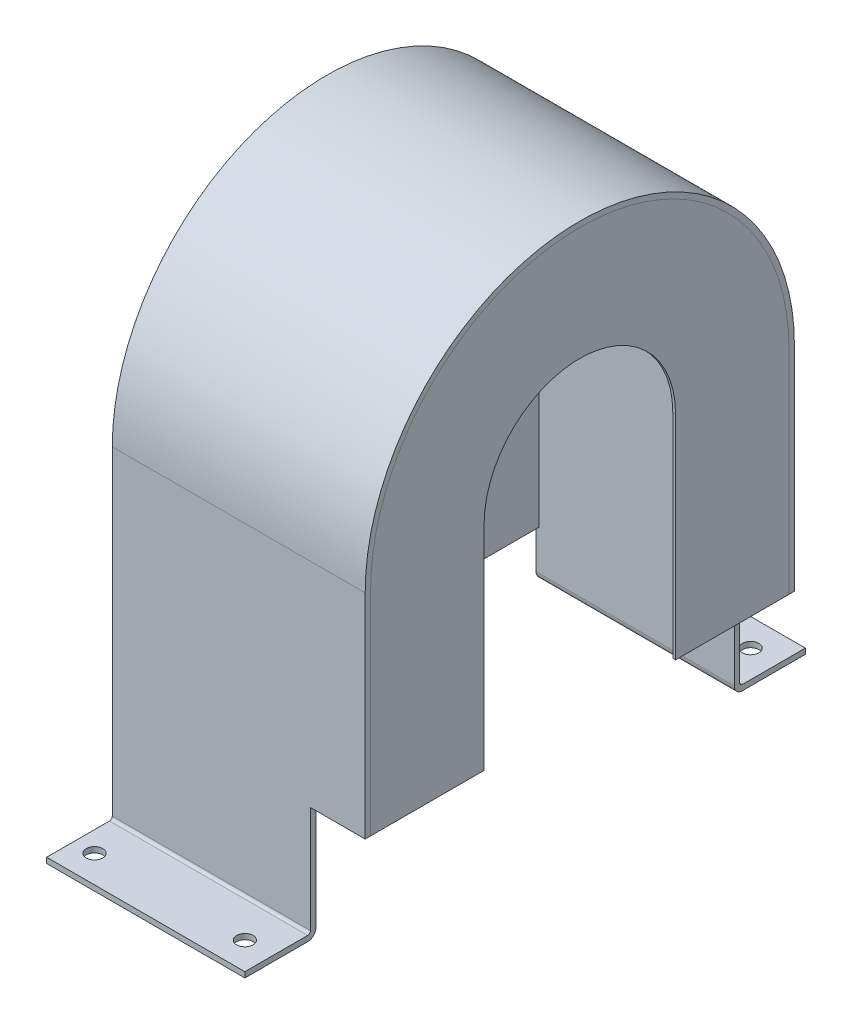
ISO-10303-21;
HEADER;
FILE_DESCRIPTION(('STEP AP214'),'2;1');
FILE_NAME('part.step','',(''),(''),'','','');
FILE_SCHEMA(('AUTOMOTIVE_DESIGN { 1 0 10303 214 1 1 1 1 }'));
ENDSEC;
DATA;
#1=APPLICATION_CONTEXT('core data for automotive mechanical design processes');
#2=APPLICATION_PROTOCOL_DEFINITION('international standard','automotive_design',2000,#1);
#3=PRODUCT_CONTEXT('',#1,'mechanical');
#4=PRODUCT('Part','Part','',(#3));
#5=PRODUCT_RELATED_PRODUCT_CATEGORY('part','',(#4));
#6=PRODUCT_DEFINITION_FORMATION('','',#4);
#7=PRODUCT_DEFINITION_CONTEXT('part definition',#1,'design');
#8=PRODUCT_DEFINITION('design','',#6,#7);
#9=PRODUCT_DEFINITION_SHAPE('','',#8);
#10=(LENGTH_UNIT() NAMED_UNIT(*) SI_UNIT(.MILLI.,.METRE.));
#11=(NAMED_UNIT(*) PLANE_ANGLE_UNIT() SI_UNIT($,.RADIAN.));
#12=(NAMED_UNIT(*) SI_UNIT($,.STERADIAN.) SOLID_ANGLE_UNIT());
#13=UNCERTAINTY_MEASURE_WITH_UNIT(LENGTH_MEASURE(1.E-05),#10,'distance_accuracy_value','');
#14=(GEOMETRIC_REPRESENTATION_CONTEXT(3) GLOBAL_UNCERTAINTY_ASSIGNED_CONTEXT((#13)) GLOBAL_UNIT_ASSIGNED_CONTEXT((#10,
#11,#12)) REPRESENTATION_CONTEXT('',''));
#15=CARTESIAN_POINT('',(0.,0.,0.));
#16=DIRECTION('',(0.,0.,1.));
#17=DIRECTION('',(1.,0.,0.));
#18=AXIS2_PLACEMENT_3D('',#15,#16,#17);
#19=CARTESIAN_POINT('',(-90.5,-205.,153.));
#20=DIRECTION('',(0.,-1.,0.));
#21=DIRECTION('',(0.,0.,-1.));
#22=AXIS2_PLACEMENT_3D('',#19,#20,#21);
#23=PLANE('',#22);
#24=DIRECTION('',(-1.,0.,0.));
#25=VECTOR('',#24,1.);
#26=CARTESIAN_POINT('',(92.5,-205.,70.));
#27=LINE('',#26,#25);
#28=CARTESIAN_POINT('',(-90.5,-205.,70.));
#29=VERTEX_POINT('',#28);
#30=CARTESIAN_POINT('',(-92.5,-205.,70.));
#31=VERTEX_POINT('',#30);
#32=EDGE_CURVE('E185',#29,#31,#27,.T.);
#33=ORIENTED_EDGE('',*,*,#32,.F.);
#34=DIRECTION('',(0.,0.,-1.));
#35=VECTOR('',#34,1.);
#36=CARTESIAN_POINT('',(-90.5,-205.,153.));
#37=LINE('',#36,#35);
#38=CARTESIAN_POINT('',(-90.5,-205.,153.));
#39=VERTEX_POINT('',#38);
#40=EDGE_CURVE('E149',#39,#29,#37,.T.);
#41=ORIENTED_EDGE('',*,*,#40,.F.);
#42=DIRECTION('',(-1.,0.,0.));
#43=VECTOR('',#42,1.);
#44=CARTESIAN_POINT('',(-90.5,-205.,153.));
#45=LINE('',#44,#43);
#46=CARTESIAN_POINT('',(-92.5,-205.,153.));
#47=VERTEX_POINT('',#46);
#48=EDGE_CURVE('E157',#39,#47,#45,.T.);
#49=ORIENTED_EDGE('',*,*,#48,.T.);
#50=DIRECTION('',(0.,0.,-1.));
#51=VECTOR('',#50,1.);
#52=CARTESIAN_POINT('',(-92.5,-205.,153.));
#53=LINE('',#52,#51);
#54=EDGE_CURVE('E160',#47,#31,#53,.T.);
#55=ORIENTED_EDGE('',*,*,#54,.T.);
#56=EDGE_LOOP('',(#33,#41,#49,#55));
#57=FACE_BOUND('',#56,.T.);
#58=ADVANCED_FACE('F58',(#57),#23,.T.);
#59=CARTESIAN_POINT('',(-90.5,0.,0.));
#60=DIRECTION('',(-1.,0.,0.));
#61=DIRECTION('',(0.,0.,-1.));
#62=AXIS2_PLACEMENT_3D('',#59,#60,#61);
#63=CYLINDRICAL_SURFACE('',#62,70.);
#64=DIRECTION('',(-1.,0.,0.));
#65=VECTOR('',#64,1.);
#66=CARTESIAN_POINT('',(-90.5,0.,70.));
#67=LINE('',#66,#65);
#68=CARTESIAN_POINT('',(-92.5,0.,70.));
#69=VERTEX_POINT('',#68);
#70=CARTESIAN_POINT('',(-90.5,0.,70.));
#71=VERTEX_POINT('',#70);
#72=EDGE_CURVE('E13',#69,#71,#67,.F.);
#73=ORIENTED_EDGE('',*,*,#72,.F.);
#74=CARTESIAN_POINT('',(-92.5,0.,0.));
#75=DIRECTION('',(1.,0.,0.));
#76=DIRECTION('',(0.,0.,-1.));
#77=AXIS2_PLACEMENT_3D('',#74,#75,#76);
#78=CIRCLE('',#77,70.);
#79=CARTESIAN_POINT('',(-92.5,0.,-70.));
#80=VERTEX_POINT('',#79);
#81=EDGE_CURVE('E132',#80,#69,#78,.T.);
#82=ORIENTED_EDGE('',*,*,#81,.F.);
#83=DIRECTION('',(-1.,0.,0.));
#84=VECTOR('',#83,1.);
#85=CARTESIAN_POINT('',(-90.5,0.,-70.));
#86=LINE('',#85,#84);
#87=CARTESIAN_POINT('',(-90.5,0.,-70.));
#88=VERTEX_POINT('',#87);
#89=EDGE_CURVE('E66',#80,#88,#86,.F.);
#90=ORIENTED_EDGE('',*,*,#89,.T.);
#91=CARTESIAN_POINT('',(-90.5,0.,0.));
#92=DIRECTION('',(1.,0.,0.));
#93=DIRECTION('',(0.,0.,-1.));
#94=AXIS2_PLACEMENT_3D('',#91,#92,#93);
#95=CIRCLE('',#94,70.);
#96=EDGE_CURVE('E137',#88,#71,#95,.T.);
#97=ORIENTED_EDGE('',*,*,#96,.T.);
#98=EDGE_LOOP('',(#73,#82,#90,#97));
#99=FACE_BOUND('',#98,.T.);
#100=ADVANCED_FACE('F136',(#99),#63,.F.);
#101=CARTESIAN_POINT('',(-90.5,0.,153.));
#102=DIRECTION('',(0.,0.,1.));
#103=DIRECTION('',(-1.,0.,0.));
#104=AXIS2_PLACEMENT_3D('',#101,#102,#103);
#105=PLANE('',#104);
#106=DIRECTION('',(0.,-1.,0.));
#107=VECTOR('',#106,1.);
#108=CARTESIAN_POINT('',(-92.5,0.,153.));
#109=LINE('',#108,#107);
#110=CARTESIAN_POINT('',(-92.5,0.,153.));
#111=VERTEX_POINT('',#110);
#112=EDGE_CURVE('E140',#111,#47,#109,.T.);
#113=ORIENTED_EDGE('',*,*,#112,.T.);
#114=ORIENTED_EDGE('',*,*,#48,.F.);
#115=DIRECTION('',(0.,-1.,0.));
#116=VECTOR('',#115,1.);
#117=CARTESIAN_POINT('',(-90.5,0.,153.));
#118=LINE('',#117,#116);
#119=CARTESIAN_POINT('',(-90.5,0.,153.));
#120=VERTEX_POINT('',#119);
#121=EDGE_CURVE('E144',#120,#39,#118,.T.);
#122=ORIENTED_EDGE('',*,*,#121,.F.);
#123=DIRECTION('',(-1.,0.,0.));
#124=VECTOR('',#123,1.);
#125=CARTESIAN_POINT('',(-90.5,0.,153.));
#126=LINE('',#125,#124);
#127=EDGE_CURVE('E127',#120,#111,#126,.T.);
#128=ORIENTED_EDGE('',*,*,#127,.T.);
#129=EDGE_LOOP('',(#113,#114,#122,#128));
#130=FACE_BOUND('',#129,.T.);
#131=ADVANCED_FACE('F60',(#130),#105,.T.);
#132=CARTESIAN_POINT('',(-90.5,0.,0.));
#133=DIRECTION('',(-1.,0.,0.));
#134=DIRECTION('',(0.,0.,-1.));
#135=AXIS2_PLACEMENT_3D('',#132,#133,#134);
#136=CYLINDRICAL_SURFACE('',#135,153.);
#137=CARTESIAN_POINT('',(-92.5,0.,0.));
#138=DIRECTION('',(-1.,0.,0.));
#139=DIRECTION('',(0.,0.,1.));
#140=AXIS2_PLACEMENT_3D('',#137,#138,#139);
#141=CIRCLE('',#140,153.);
#142=CARTESIAN_POINT('',(-92.5,0.,-153.));
#143=VERTEX_POINT('',#142);
#144=EDGE_CURVE('E148',#111,#143,#141,.T.);
#145=ORIENTED_EDGE('',*,*,#144,.F.);
#146=ORIENTED_EDGE('',*,*,#127,.F.);
#147=CARTESIAN_POINT('',(-90.5,0.,0.));
#148=DIRECTION('',(-1.,0.,0.));
#149=DIRECTION('',(0.,0.,1.));
#150=AXIS2_PLACEMENT_3D('',#147,#148,#149);
#151=CIRCLE('',#150,153.);
#152=CARTESIAN_POINT('',(-90.5,0.,-153.));
#153=VERTEX_POINT('',#152);
#154=EDGE_CURVE('E154',#120,#153,#151,.T.);
#155=ORIENTED_EDGE('',*,*,#154,.T.);
#156=DIRECTION('',(-1.,0.,0.));
#157=VECTOR('',#156,1.);
#158=CARTESIAN_POINT('',(-90.5,0.,-153.));
#159=LINE('',#158,#157);
#160=EDGE_CURVE('E169',#153,#143,#159,.T.);
#161=ORIENTED_EDGE('',*,*,#160,.T.);
#162=EDGE_LOOP('',(#145,#146,#155,#161));
#163=FACE_BOUND('',#162,.T.);
#164=ADVANCED_FACE('F196',(#163),#136,.T.);
#165=CARTESIAN_POINT('',(-90.5,-205.,-153.));
#166=DIRECTION('',(0.,0.,-1.));
#167=DIRECTION('',(0.,1.,0.));
#168=AXIS2_PLACEMENT_3D('',#165,#166,#167);
#169=PLANE('',#168);
#170=DIRECTION('',(0.,1.,0.));
#171=VECTOR('',#170,1.);
#172=CARTESIAN_POINT('',(-92.5,-205.,-153.));
#173=LINE('',#172,#171);
#174=CARTESIAN_POINT('',(-92.5,-205.,-153.));
#175=VERTEX_POINT('',#174);
#176=EDGE_CURVE('E163',#175,#143,#173,.T.);
#177=ORIENTED_EDGE('',*,*,#176,.T.);
#178=ORIENTED_EDGE('',*,*,#160,.F.);
#179=DIRECTION('',(0.,1.,0.));
#180=VECTOR('',#179,1.);
#181=CARTESIAN_POINT('',(-90.5,-205.,-153.));
#182=LINE('',#181,#180);
#183=CARTESIAN_POINT('',(-90.5,-205.,-153.));
#184=VERTEX_POINT('',#183);
#185=EDGE_CURVE('E152',#184,#153,#182,.T.);
#186=ORIENTED_EDGE('',*,*,#185,.F.);
#187=DIRECTION('',(-1.,0.,0.));
#188=VECTOR('',#187,1.);
#189=CARTESIAN_POINT('',(-90.5,-205.,-153.));
#190=LINE('',#189,#188);
#191=EDGE_CURVE('E172',#184,#175,#190,.T.);
#192=ORIENTED_EDGE('',*,*,#191,.T.);
#193=EDGE_LOOP('',(#177,#178,#186,#192));
#194=FACE_BOUND('',#193,.T.);
#195=ADVANCED_FACE('F198',(#194),#169,.T.);
#196=DIRECTION('',(-1.,0.,0.));
#197=VECTOR('',#196,1.);
#198=CARTESIAN_POINT('',(92.5,-205.,-70.));
#199=LINE('',#198,#197);
#200=CARTESIAN_POINT('',(-90.5,-205.,-70.));
#201=VERTEX_POINT('',#200);
#202=CARTESIAN_POINT('',(-92.5,-205.,-70.));
#203=VERTEX_POINT('',#202);
#204=EDGE_CURVE('E183',#201,#203,#199,.T.);
#205=ORIENTED_EDGE('',*,*,#204,.T.);
#206=EDGE_CURVE('E134',#203,#175,#53,.T.);
#207=ORIENTED_EDGE('',*,*,#206,.T.);
#208=ORIENTED_EDGE('',*,*,#191,.F.);
#209=EDGE_CURVE('E147',#201,#184,#37,.T.);
#210=ORIENTED_EDGE('',*,*,#209,.F.);
#211=EDGE_LOOP('',(#205,#207,#208,#210));
#212=FACE_BOUND('',#211,.T.);
#213=ADVANCED_FACE('F202',(#212),#23,.T.);
#214=CARTESIAN_POINT('',(-90.5,0.,0.));
#215=DIRECTION('',(1.,0.,0.));
#216=DIRECTION('',(0.,0.,1.));
#217=AXIS2_PLACEMENT_3D('',#214,#215,#216);
#218=PLANE('',#217);
#219=DIRECTION('',(0.,-1.,0.));
#220=VECTOR('',#219,1.);
#221=CARTESIAN_POINT('',(-90.5,0.,70.));
#222=LINE('',#221,#220);
#223=EDGE_CURVE('E138',#71,#29,#222,.T.);
#224=ORIENTED_EDGE('',*,*,#223,.F.);
#225=ORIENTED_EDGE('',*,*,#96,.F.);
#226=DIRECTION('',(0.,1.,0.));
#227=VECTOR('',#226,1.);
#228=CARTESIAN_POINT('',(-90.5,0.,-70.));
#229=LINE('',#228,#227);
#230=EDGE_CURVE('E80',#201,#88,#229,.T.);
#231=ORIENTED_EDGE('',*,*,#230,.F.);
#232=ORIENTED_EDGE('',*,*,#209,.T.);
#233=ORIENTED_EDGE('',*,*,#185,.T.);
#234=ORIENTED_EDGE('',*,*,#154,.F.);
#235=ORIENTED_EDGE('',*,*,#121,.T.);
#236=ORIENTED_EDGE('',*,*,#40,.T.);
#237=EDGE_LOOP('',(#224,#225,#231,#232,#233,#234,#235,#236));
#238=FACE_BOUND('',#237,.T.);
#239=ADVANCED_FACE('F192',(#238),#218,.T.);
#240=CARTESIAN_POINT('',(-92.5,0.,0.));
#241=DIRECTION('',(1.,0.,0.));
#242=DIRECTION('',(0.,0.,1.));
#243=AXIS2_PLACEMENT_3D('',#240,#241,#242);
#244=PLANE('',#243);
#245=ORIENTED_EDGE('',*,*,#81,.T.);
#246=DIRECTION('',(0.,1.,0.));
#247=VECTOR('',#246,1.);
#248=CARTESIAN_POINT('',(-92.5,0.,70.));
#249=LINE('',#248,#247);
#250=EDGE_CURVE('E72',#31,#69,#249,.T.);
#251=ORIENTED_EDGE('',*,*,#250,.F.);
#252=ORIENTED_EDGE('',*,*,#54,.F.);
#253=ORIENTED_EDGE('',*,*,#112,.F.);
#254=ORIENTED_EDGE('',*,*,#144,.T.);
#255=ORIENTED_EDGE('',*,*,#176,.F.);
#256=ORIENTED_EDGE('',*,*,#206,.F.);
#257=DIRECTION('',(0.,-1.,0.));
#258=VECTOR('',#257,1.);
#259=CARTESIAN_POINT('',(-92.5,-205.,-70.));
#260=LINE('',#259,#258);
#261=EDGE_CURVE('E121',#80,#203,#260,.T.);
#262=ORIENTED_EDGE('',*,*,#261,.F.);
#263=EDGE_LOOP('',(#245,#251,#252,#253,#254,#255,#256,#262));
#264=FACE_BOUND('',#263,.T.);
#265=ADVANCED_FACE('F131',(#264),#244,.F.);
#266=CARTESIAN_POINT('',(92.5,-205.,-70.));
#267=DIRECTION('',(0.,0.,-1.));
#268=DIRECTION('',(-1.,0.,0.));
#269=AXIS2_PLACEMENT_3D('',#266,#267,#268);
#270=PLANE('',#269);
#271=ORIENTED_EDGE('',*,*,#230,.T.);
#272=ORIENTED_EDGE('',*,*,#89,.F.);
#273=ORIENTED_EDGE('',*,*,#261,.T.);
#274=ORIENTED_EDGE('',*,*,#204,.F.);
#275=EDGE_LOOP('',(#271,#272,#273,#274));
#276=FACE_BOUND('',#275,.T.);
#277=ADVANCED_FACE('F120',(#276),#270,.F.);
#278=CARTESIAN_POINT('',(92.5,0.,70.));
#279=DIRECTION('',(0.,0.,1.));
#280=DIRECTION('',(1.,0.,0.));
#281=AXIS2_PLACEMENT_3D('',#278,#279,#280);
#282=PLANE('',#281);
#283=ORIENTED_EDGE('',*,*,#223,.T.);
#284=ORIENTED_EDGE('',*,*,#32,.T.);
#285=ORIENTED_EDGE('',*,*,#250,.T.);
#286=ORIENTED_EDGE('',*,*,#72,.T.);
#287=EDGE_LOOP('',(#283,#284,#285,#286));
#288=FACE_BOUND('',#287,.T.);
#289=ADVANCED_FACE('F189',(#288),#282,.F.);
#290=CLOSED_SHELL('',(#58,#100,#131,#164,#195,#213,#239,#265,#277,#289));
#291=MANIFOLD_SOLID_BREP('B2',#290);
#292=CARTESIAN_POINT('',(90.5,0.,153.));
#293=DIRECTION('',(0.,0.,1.));
#294=DIRECTION('',(1.,0.,0.));
#295=AXIS2_PLACEMENT_3D('',#292,#293,#294);
#296=PLANE('',#295);
#297=DIRECTION('',(1.,0.,0.));
#298=VECTOR('',#297,1.);
#299=CARTESIAN_POINT('',(-219.398370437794,-156.,153.));
#300=LINE('',#299,#298);
#301=CARTESIAN_POINT('',(90.5,-156.,153.));
#302=VERTEX_POINT('',#301);
#303=CARTESIAN_POINT('',(92.5,-156.,153.));
#304=VERTEX_POINT('',#303);
#305=EDGE_CURVE('E355',#302,#304,#300,.T.);
#306=ORIENTED_EDGE('',*,*,#305,.T.);
#307=DIRECTION('',(0.,-1.,0.));
#308=VECTOR('',#307,1.);
#309=CARTESIAN_POINT('',(92.5,0.,153.));
#310=LINE('',#309,#308);
#311=CARTESIAN_POINT('',(92.5,0.,153.));
#312=VERTEX_POINT('',#311);
#313=EDGE_CURVE('E363',#312,#304,#310,.T.);
#314=ORIENTED_EDGE('',*,*,#313,.F.);
#315=DIRECTION('',(1.,0.,0.));
#316=VECTOR('',#315,1.);
#317=CARTESIAN_POINT('',(90.5,0.,153.));
#318=LINE('',#317,#316);
#319=CARTESIAN_POINT('',(90.5,0.,153.));
#320=VERTEX_POINT('',#319);
#321=EDGE_CURVE('E298',#320,#312,#318,.T.);
#322=ORIENTED_EDGE('',*,*,#321,.F.);
#323=DIRECTION('',(0.,-1.,0.));
#324=VECTOR('',#323,1.);
#325=CARTESIAN_POINT('',(90.5,0.,153.));
#326=LINE('',#325,#324);
#327=EDGE_CURVE('E365',#320,#302,#326,.T.);
#328=ORIENTED_EDGE('',*,*,#327,.T.);
#329=EDGE_LOOP('',(#306,#314,#322,#328));
#330=FACE_BOUND('',#329,.T.);
#331=ADVANCED_FACE('F291',(#330),#296,.T.);
#332=CARTESIAN_POINT('',(90.5,0.,0.));
#333=DIRECTION('',(1.,0.,0.));
#334=DIRECTION('',(0.,0.,-1.));
#335=AXIS2_PLACEMENT_3D('',#332,#333,#334);
#336=CYLINDRICAL_SURFACE('',#335,153.);
#337=CARTESIAN_POINT('',(92.5,0.,0.));
#338=DIRECTION('',(-1.,0.,0.));
#339=DIRECTION('',(0.,0.,1.));
#340=AXIS2_PLACEMENT_3D('',#337,#338,#339);
#341=CIRCLE('',#340,153.);
#342=CARTESIAN_POINT('',(92.5,0.,-153.));
#343=VERTEX_POINT('',#342);
#344=EDGE_CURVE('E372',#312,#343,#341,.T.);
#345=ORIENTED_EDGE('',*,*,#344,.T.);
#346=DIRECTION('',(1.,0.,0.));
#347=VECTOR('',#346,1.);
#348=CARTESIAN_POINT('',(90.5,0.,-153.));
#349=LINE('',#348,#347);
#350=CARTESIAN_POINT('',(90.5,0.,-153.));
#351=VERTEX_POINT('',#350);
#352=EDGE_CURVE('E385',#351,#343,#349,.T.);
#353=ORIENTED_EDGE('',*,*,#352,.F.);
#354=CARTESIAN_POINT('',(90.5,0.,0.));
#355=DIRECTION('',(-1.,0.,0.));
#356=DIRECTION('',(0.,0.,1.));
#357=AXIS2_PLACEMENT_3D('',#354,#355,#356);
#358=CIRCLE('',#357,153.);
#359=EDGE_CURVE('E381',#320,#351,#358,.T.);
#360=ORIENTED_EDGE('',*,*,#359,.F.);
#361=ORIENTED_EDGE('',*,*,#321,.T.);
#362=EDGE_LOOP('',(#345,#353,#360,#361));
#363=FACE_BOUND('',#362,.T.);
#364=ADVANCED_FACE('F435',(#363),#336,.T.);
#365=CARTESIAN_POINT('',(90.5,-205.,-153.));
#366=DIRECTION('',(0.,0.,-1.));
#367=DIRECTION('',(0.,1.,0.));
#368=AXIS2_PLACEMENT_3D('',#365,#366,#367);
#369=PLANE('',#368);
#370=DIRECTION('',(1.,0.,0.));
#371=VECTOR('',#370,1.);
#372=CARTESIAN_POINT('',(-219.398370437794,-156.,-153.));
#373=LINE('',#372,#371);
#374=CARTESIAN_POINT('',(90.5,-156.,-153.));
#375=VERTEX_POINT('',#374);
#376=CARTESIAN_POINT('',(92.5,-156.,-153.));
#377=VERTEX_POINT('',#376);
#378=EDGE_CURVE('E416',#375,#377,#373,.T.);
#379=ORIENTED_EDGE('',*,*,#378,.F.);
#380=DIRECTION('',(0.,1.,0.));
#381=VECTOR('',#380,1.);
#382=CARTESIAN_POINT('',(90.5,-205.,-153.));
#383=LINE('',#382,#381);
#384=EDGE_CURVE('E391',#375,#351,#383,.T.);
#385=ORIENTED_EDGE('',*,*,#384,.T.);
#386=ORIENTED_EDGE('',*,*,#352,.T.);
#387=DIRECTION('',(0.,1.,0.));
#388=VECTOR('',#387,1.);
#389=CARTESIAN_POINT('',(92.5,-205.,-153.));
#390=LINE('',#389,#388);
#391=EDGE_CURVE('E373',#377,#343,#390,.T.);
#392=ORIENTED_EDGE('',*,*,#391,.F.);
#393=EDGE_LOOP('',(#379,#385,#386,#392));
#394=FACE_BOUND('',#393,.T.);
#395=ADVANCED_FACE('F433',(#394),#369,.T.);
#396=CARTESIAN_POINT('',(90.5,0.,0.));
#397=DIRECTION('',(-1.,0.,0.));
#398=DIRECTION('',(0.,0.,1.));
#399=AXIS2_PLACEMENT_3D('',#396,#397,#398);
#400=PLANE('',#399);
#401=DIRECTION('',(0.,0.,1.));
#402=VECTOR('',#401,1.);
#403=CARTESIAN_POINT('',(90.5,-156.,153.));
#404=LINE('',#403,#402);
#405=CARTESIAN_POINT('',(90.5,-156.,70.));
#406=VERTEX_POINT('',#405);
#407=EDGE_CURVE('E313',#406,#302,#404,.T.);
#408=ORIENTED_EDGE('',*,*,#407,.T.);
#409=ORIENTED_EDGE('',*,*,#327,.F.);
#410=ORIENTED_EDGE('',*,*,#359,.T.);
#411=ORIENTED_EDGE('',*,*,#384,.F.);
#412=CARTESIAN_POINT('',(90.5,-156.,-70.));
#413=VERTEX_POINT('',#412);
#414=EDGE_CURVE('E367',#375,#413,#404,.T.);
#415=ORIENTED_EDGE('',*,*,#414,.T.);
#416=DIRECTION('',(0.,-1.,0.));
#417=VECTOR('',#416,1.);
#418=CARTESIAN_POINT('',(90.5,0.,-70.));
#419=LINE('',#418,#417);
#420=CARTESIAN_POINT('',(90.5,0.,-70.));
#421=VERTEX_POINT('',#420);
#422=EDGE_CURVE('E402',#421,#413,#419,.T.);
#423=ORIENTED_EDGE('',*,*,#422,.F.);
#424=CARTESIAN_POINT('',(90.5,0.,0.));
#425=DIRECTION('',(1.,0.,0.));
#426=DIRECTION('',(0.,0.,-1.));
#427=AXIS2_PLACEMENT_3D('',#424,#425,#426);
#428=CIRCLE('',#427,70.);
#429=CARTESIAN_POINT('',(90.5,0.,70.));
#430=VERTEX_POINT('',#429);
#431=EDGE_CURVE('E374',#421,#430,#428,.T.);
#432=ORIENTED_EDGE('',*,*,#431,.T.);
#433=DIRECTION('',(0.,1.,0.));
#434=VECTOR('',#433,1.);
#435=CARTESIAN_POINT('',(90.5,0.,70.));
#436=LINE('',#435,#434);
#437=EDGE_CURVE('E399',#406,#430,#436,.T.);
#438=ORIENTED_EDGE('',*,*,#437,.F.);
#439=EDGE_LOOP('',(#408,#409,#410,#411,#415,#423,#432,#438));
#440=FACE_BOUND('',#439,.T.);
#441=ADVANCED_FACE('F421',(#440),#400,.T.);
#442=CARTESIAN_POINT('',(92.5,0.,0.));
#443=DIRECTION('',(-1.,0.,0.));
#444=DIRECTION('',(0.,0.,1.));
#445=AXIS2_PLACEMENT_3D('',#442,#443,#444);
#446=PLANE('',#445);
#447=ORIENTED_EDGE('',*,*,#313,.T.);
#448=DIRECTION('',(0.,0.,1.));
#449=VECTOR('',#448,1.);
#450=CARTESIAN_POINT('',(92.5,-156.,153.));
#451=LINE('',#450,#449);
#452=CARTESIAN_POINT('',(92.5,-156.,70.));
#453=VERTEX_POINT('',#452);
#454=EDGE_CURVE('E352',#453,#304,#451,.T.);
#455=ORIENTED_EDGE('',*,*,#454,.F.);
#456=DIRECTION('',(0.,1.,0.));
#457=VECTOR('',#456,1.);
#458=CARTESIAN_POINT('',(92.5,0.,70.));
#459=LINE('',#458,#457);
#460=CARTESIAN_POINT('',(92.5,0.,70.));
#461=VERTEX_POINT('',#460);
#462=EDGE_CURVE('E408',#453,#461,#459,.T.);
#463=ORIENTED_EDGE('',*,*,#462,.T.);
#464=CARTESIAN_POINT('',(92.5,0.,0.));
#465=DIRECTION('',(1.,0.,0.));
#466=DIRECTION('',(0.,0.,-1.));
#467=AXIS2_PLACEMENT_3D('',#464,#465,#466);
#468=CIRCLE('',#467,70.);
#469=CARTESIAN_POINT('',(92.5,0.,-70.));
#470=VERTEX_POINT('',#469);
#471=EDGE_CURVE('E378',#470,#461,#468,.T.);
#472=ORIENTED_EDGE('',*,*,#471,.F.);
#473=DIRECTION('',(0.,-1.,0.));
#474=VECTOR('',#473,1.);
#475=CARTESIAN_POINT('',(92.5,-205.,-70.));
#476=LINE('',#475,#474);
#477=CARTESIAN_POINT('',(92.5,-156.,-70.));
#478=VERTEX_POINT('',#477);
#479=EDGE_CURVE('E412',#470,#478,#476,.T.);
#480=ORIENTED_EDGE('',*,*,#479,.T.);
#481=EDGE_CURVE('E305',#377,#478,#451,.T.);
#482=ORIENTED_EDGE('',*,*,#481,.F.);
#483=ORIENTED_EDGE('',*,*,#391,.T.);
#484=ORIENTED_EDGE('',*,*,#344,.F.);
#485=EDGE_LOOP('',(#447,#455,#463,#472,#480,#482,#483,#484));
#486=FACE_BOUND('',#485,.T.);
#487=ADVANCED_FACE('F370',(#486),#446,.F.);
#488=CARTESIAN_POINT('',(90.5,0.,0.));
#489=DIRECTION('',(1.,0.,0.));
#490=DIRECTION('',(0.,0.,-1.));
#491=AXIS2_PLACEMENT_3D('',#488,#489,#490);
#492=CYLINDRICAL_SURFACE('',#491,70.);
#493=ORIENTED_EDGE('',*,*,#471,.T.);
#494=DIRECTION('',(-1.,0.,0.));
#495=VECTOR('',#494,1.);
#496=CARTESIAN_POINT('',(92.5,0.,70.));
#497=LINE('',#496,#495);
#498=EDGE_CURVE('E405',#461,#430,#497,.T.);
#499=ORIENTED_EDGE('',*,*,#498,.T.);
#500=ORIENTED_EDGE('',*,*,#431,.F.);
#501=DIRECTION('',(-1.,0.,0.));
#502=VECTOR('',#501,1.);
#503=CARTESIAN_POINT('',(92.5,0.,-70.));
#504=LINE('',#503,#502);
#505=EDGE_CURVE('E406',#470,#421,#504,.T.);
#506=ORIENTED_EDGE('',*,*,#505,.F.);
#507=EDGE_LOOP('',(#493,#499,#500,#506));
#508=FACE_BOUND('',#507,.T.);
#509=ADVANCED_FACE('F427',(#508),#492,.F.);
#510=CARTESIAN_POINT('',(92.5,-205.,-70.));
#511=DIRECTION('',(0.,0.,-1.));
#512=DIRECTION('',(-1.,0.,0.));
#513=AXIS2_PLACEMENT_3D('',#510,#511,#512);
#514=PLANE('',#513);
#515=ORIENTED_EDGE('',*,*,#422,.T.);
#516=DIRECTION('',(1.,0.,0.));
#517=VECTOR('',#516,1.);
#518=CARTESIAN_POINT('',(92.5,-156.,-70.));
#519=LINE('',#518,#517);
#520=EDGE_CURVE('E366',#413,#478,#519,.T.);
#521=ORIENTED_EDGE('',*,*,#520,.T.);
#522=ORIENTED_EDGE('',*,*,#479,.F.);
#523=ORIENTED_EDGE('',*,*,#505,.T.);
#524=EDGE_LOOP('',(#515,#521,#522,#523));
#525=FACE_BOUND('',#524,.T.);
#526=ADVANCED_FACE('F431',(#525),#514,.F.);
#527=CARTESIAN_POINT('',(92.5,0.,70.));
#528=DIRECTION('',(0.,0.,1.));
#529=DIRECTION('',(1.,0.,0.));
#530=AXIS2_PLACEMENT_3D('',#527,#528,#529);
#531=PLANE('',#530);
#532=ORIENTED_EDGE('',*,*,#462,.F.);
#533=DIRECTION('',(-1.,0.,0.));
#534=VECTOR('',#533,1.);
#535=CARTESIAN_POINT('',(92.5,-156.,70.));
#536=LINE('',#535,#534);
#537=EDGE_CURVE('E56',#453,#406,#536,.T.);
#538=ORIENTED_EDGE('',*,*,#537,.T.);
#539=ORIENTED_EDGE('',*,*,#437,.T.);
#540=ORIENTED_EDGE('',*,*,#498,.F.);
#541=EDGE_LOOP('',(#532,#538,#539,#540));
#542=FACE_BOUND('',#541,.T.);
#543=ADVANCED_FACE('F425',(#542),#531,.F.);
#544=CARTESIAN_POINT('',(-219.398370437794,-156.,153.));
#545=DIRECTION('',(0.,1.,0.));
#546=DIRECTION('',(0.,0.,1.));
#547=AXIS2_PLACEMENT_3D('',#544,#545,#546);
#548=PLANE('',#547);
#549=ORIENTED_EDGE('',*,*,#454,.T.);
#550=ORIENTED_EDGE('',*,*,#305,.F.);
#551=ORIENTED_EDGE('',*,*,#407,.F.);
#552=ORIENTED_EDGE('',*,*,#537,.F.);
#553=EDGE_LOOP('',(#549,#550,#551,#552));
#554=FACE_BOUND('',#553,.T.);
#555=ADVANCED_FACE('F354',(#554),#548,.F.);
#556=ORIENTED_EDGE('',*,*,#414,.F.);
#557=ORIENTED_EDGE('',*,*,#378,.T.);
#558=ORIENTED_EDGE('',*,*,#481,.T.);
#559=ORIENTED_EDGE('',*,*,#520,.F.);
#560=EDGE_LOOP('',(#556,#557,#558,#559));
#561=FACE_BOUND('',#560,.T.);
#562=ADVANCED_FACE('F432',(#561),#548,.F.);
#563=CLOSED_SHELL('',(#331,#364,#395,#441,#487,#509,#526,#543,#555,#562));
#564=MANIFOLD_SOLID_BREP('B7',#563);
#565=CARTESIAN_POINT('',(92.5,0.,-157.));
#566=DIRECTION('',(0.,0.,-1.));
#567=DIRECTION('',(-1.,0.,0.));
#568=AXIS2_PLACEMENT_3D('',#565,#566,#567);
#569=PLANE('',#568);
#570=DIRECTION('',(1.,0.,0.));
#571=VECTOR('',#570,1.);
#572=CARTESIAN_POINT('',(92.5,-156.,-157.));
#573=LINE('',#572,#571);
#574=CARTESIAN_POINT('',(52.5,-156.,-157.));
#575=VERTEX_POINT('',#574);
#576=CARTESIAN_POINT('',(92.5,-156.,-157.));
#577=VERTEX_POINT('',#576);
#578=EDGE_CURVE('E537',#575,#577,#573,.T.);
#579=ORIENTED_EDGE('',*,*,#578,.F.);
#580=DIRECTION('',(0.,-1.,0.));
#581=VECTOR('',#580,1.);
#582=CARTESIAN_POINT('',(52.5,0.,-157.));
#583=LINE('',#582,#581);
#584=CARTESIAN_POINT('',(52.5,-234.,-157.));
#585=VERTEX_POINT('',#584);
#586=EDGE_CURVE('E765',#575,#585,#583,.T.);
#587=ORIENTED_EDGE('',*,*,#586,.T.);
#588=DIRECTION('',(-1.,0.,0.));
#589=VECTOR('',#588,1.);
#590=CARTESIAN_POINT('',(92.5,-234.,-157.));
#591=LINE('',#590,#589);
#592=CARTESIAN_POINT('',(-92.5,-234.,-157.));
#593=VERTEX_POINT('',#592);
#594=EDGE_CURVE('E676',#585,#593,#591,.T.);
#595=ORIENTED_EDGE('',*,*,#594,.T.);
#596=DIRECTION('',(0.,-1.,0.));
#597=VECTOR('',#596,1.);
#598=CARTESIAN_POINT('',(-92.5,0.,-157.));
#599=LINE('',#598,#597);
#600=CARTESIAN_POINT('',(-92.5,0.,-157.));
#601=VERTEX_POINT('',#600);
#602=EDGE_CURVE('E682',#601,#593,#599,.T.);
#603=ORIENTED_EDGE('',*,*,#602,.F.);
#604=DIRECTION('',(-1.,0.,0.));
#605=VECTOR('',#604,1.);
#606=CARTESIAN_POINT('',(92.5,0.,-157.));
#607=LINE('',#606,#605);
#608=CARTESIAN_POINT('',(92.5,0.,-157.));
#609=VERTEX_POINT('',#608);
#610=EDGE_CURVE('E659',#609,#601,#607,.T.);
#611=ORIENTED_EDGE('',*,*,#610,.F.);
#612=DIRECTION('',(0.,-1.,0.));
#613=VECTOR('',#612,1.);
#614=CARTESIAN_POINT('',(92.5,0.,-157.));
#615=LINE('',#614,#613);
#616=EDGE_CURVE('E730',#609,#577,#615,.T.);
#617=ORIENTED_EDGE('',*,*,#616,.T.);
#618=EDGE_LOOP('',(#579,#587,#595,#603,#611,#617));
#619=FACE_BOUND('',#618,.T.);
#620=ADVANCED_FACE('F515',(#619),#569,.T.);
#621=CARTESIAN_POINT('',(92.5,0.,157.));
#622=DIRECTION('',(0.,0.,-1.));
#623=DIRECTION('',(-1.,0.,0.));
#624=AXIS2_PLACEMENT_3D('',#621,#622,#623);
#625=PLANE('',#624);
#626=DIRECTION('',(0.,-1.,0.));
#627=VECTOR('',#626,1.);
#628=CARTESIAN_POINT('',(52.5,0.,157.));
#629=LINE('',#628,#627);
#630=CARTESIAN_POINT('',(52.5,-156.,157.));
#631=VERTEX_POINT('',#630);
#632=CARTESIAN_POINT('',(52.5,-234.,157.));
#633=VERTEX_POINT('',#632);
#634=EDGE_CURVE('E667',#631,#633,#629,.T.);
#635=ORIENTED_EDGE('',*,*,#634,.F.);
#636=DIRECTION('',(1.,0.,0.));
#637=VECTOR('',#636,1.);
#638=CARTESIAN_POINT('',(92.5,-156.,157.));
#639=LINE('',#638,#637);
#640=CARTESIAN_POINT('',(92.5,-156.,157.));
#641=VERTEX_POINT('',#640);
#642=EDGE_CURVE('E653',#631,#641,#639,.T.);
#643=ORIENTED_EDGE('',*,*,#642,.T.);
#644=DIRECTION('',(0.,-1.,0.));
#645=VECTOR('',#644,1.);
#646=CARTESIAN_POINT('',(92.5,0.,157.));
#647=LINE('',#646,#645);
#648=CARTESIAN_POINT('',(92.5,0.,157.));
#649=VERTEX_POINT('',#648);
#650=EDGE_CURVE('E665',#649,#641,#647,.T.);
#651=ORIENTED_EDGE('',*,*,#650,.F.);
#652=DIRECTION('',(-1.,0.,0.));
#653=VECTOR('',#652,1.);
#654=CARTESIAN_POINT('',(92.5,0.,157.));
#655=LINE('',#654,#653);
#656=CARTESIAN_POINT('',(-92.5,0.,157.));
#657=VERTEX_POINT('',#656);
#658=EDGE_CURVE('E732',#649,#657,#655,.T.);
#659=ORIENTED_EDGE('',*,*,#658,.T.);
#660=DIRECTION('',(0.,-1.,0.));
#661=VECTOR('',#660,1.);
#662=CARTESIAN_POINT('',(-92.5,0.,157.));
#663=LINE('',#662,#661);
#664=CARTESIAN_POINT('',(-92.5,-234.,157.));
#665=VERTEX_POINT('',#664);
#666=EDGE_CURVE('E725',#657,#665,#663,.T.);
#667=ORIENTED_EDGE('',*,*,#666,.T.);
#668=DIRECTION('',(-1.,0.,0.));
#669=VECTOR('',#668,1.);
#670=CARTESIAN_POINT('',(92.5,-234.,157.));
#671=LINE('',#670,#669);
#672=EDGE_CURVE('E734',#633,#665,#671,.T.);
#673=ORIENTED_EDGE('',*,*,#672,.F.);
#674=EDGE_LOOP('',(#635,#643,#651,#659,#667,#673));
#675=FACE_BOUND('',#674,.T.);
#676=ADVANCED_FACE('F663',(#675),#625,.F.);
#677=CARTESIAN_POINT('',(92.5,-234.,159.));
#678=DIRECTION('',(-1.,0.,0.));
#679=DIRECTION('',(0.,0.,1.));
#680=AXIS2_PLACEMENT_3D('',#677,#678,#679);
#681=CYLINDRICAL_SURFACE('',#680,2.00000000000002);
#682=CARTESIAN_POINT('',(52.5,-234.,159.));
#683=DIRECTION('',(1.,0.,0.));
#684=DIRECTION('',(0.,0.,-1.));
#685=AXIS2_PLACEMENT_3D('',#682,#683,#684);
#686=CIRCLE('',#685,2.00000000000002);
#687=CARTESIAN_POINT('',(52.5,-236.,159.));
#688=VERTEX_POINT('',#687);
#689=EDGE_CURVE('E783',#633,#688,#686,.F.);
#690=ORIENTED_EDGE('',*,*,#689,.F.);
#691=ORIENTED_EDGE('',*,*,#672,.T.);
#692=CARTESIAN_POINT('',(-92.5,-234.,159.));
#693=DIRECTION('',(-1.,0.,0.));
#694=DIRECTION('',(0.,0.,1.));
#695=AXIS2_PLACEMENT_3D('',#692,#693,#694);
#696=CIRCLE('',#695,2.00000000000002);
#697=CARTESIAN_POINT('',(-92.5,-236.,159.));
#698=VERTEX_POINT('',#697);
#699=EDGE_CURVE('E722',#665,#698,#696,.T.);
#700=ORIENTED_EDGE('',*,*,#699,.T.);
#701=DIRECTION('',(-1.,0.,0.));
#702=VECTOR('',#701,1.);
#703=CARTESIAN_POINT('',(92.5,-236.,159.));
#704=LINE('',#703,#702);
#705=EDGE_CURVE('E736',#688,#698,#704,.T.);
#706=ORIENTED_EDGE('',*,*,#705,.F.);
#707=EDGE_LOOP('',(#690,#691,#700,#706));
#708=FACE_BOUND('',#707,.T.);
#709=ADVANCED_FACE('F782',(#708),#681,.F.);
#710=CARTESIAN_POINT('',(92.5,-236.,159.));
#711=DIRECTION('',(0.,-1.,0.));
#712=DIRECTION('',(0.,0.,-1.));
#713=AXIS2_PLACEMENT_3D('',#710,#711,#712);
#714=PLANE('',#713);
#715=CARTESIAN_POINT('',(-77.5,-236.,185.));
#716=DIRECTION('',(0.,1.,0.));
#717=DIRECTION('',(0.,0.,1.));
#718=AXIS2_PLACEMENT_3D('',#715,#716,#717);
#719=CIRCLE('',#718,6.);
#720=CARTESIAN_POINT('',(-77.5,-236.,191.));
#721=VERTEX_POINT('',#720);
#722=EDGE_CURVE('E809',#721,#721,#719,.T.);
#723=ORIENTED_EDGE('',*,*,#722,.F.);
#724=EDGE_LOOP('',(#723));
#725=FACE_BOUND('',#724,.T.);
#726=CARTESIAN_POINT('',(32.5,-236.,185.));
#727=DIRECTION('',(0.,1.,0.));
#728=DIRECTION('',(0.,0.,1.));
#729=AXIS2_PLACEMENT_3D('',#726,#727,#728);
#730=CIRCLE('',#729,6.);
#731=CARTESIAN_POINT('',(32.5,-236.,191.));
#732=VERTEX_POINT('',#731);
#733=EDGE_CURVE('E803',#732,#732,#730,.T.);
#734=ORIENTED_EDGE('',*,*,#733,.F.);
#735=EDGE_LOOP('',(#734));
#736=FACE_BOUND('',#735,.T.);
#737=DIRECTION('',(0.,0.,1.));
#738=VECTOR('',#737,1.);
#739=CARTESIAN_POINT('',(52.5,-236.,159.));
#740=LINE('',#739,#738);
#741=CARTESIAN_POINT('',(52.5,-236.,205.));
#742=VERTEX_POINT('',#741);
#743=EDGE_CURVE('E786',#688,#742,#740,.T.);
#744=ORIENTED_EDGE('',*,*,#743,.F.);
#745=ORIENTED_EDGE('',*,*,#705,.T.);
#746=DIRECTION('',(0.,0.,1.));
#747=VECTOR('',#746,1.);
#748=CARTESIAN_POINT('',(-92.5,-236.,159.));
#749=LINE('',#748,#747);
#750=CARTESIAN_POINT('',(-92.5,-236.,205.));
#751=VERTEX_POINT('',#750);
#752=EDGE_CURVE('E719',#698,#751,#749,.T.);
#753=ORIENTED_EDGE('',*,*,#752,.T.);
#754=DIRECTION('',(-1.,0.,0.));
#755=VECTOR('',#754,1.);
#756=CARTESIAN_POINT('',(92.5,-236.,205.));
#757=LINE('',#756,#755);
#758=EDGE_CURVE('E738',#742,#751,#757,.T.);
#759=ORIENTED_EDGE('',*,*,#758,.F.);
#760=EDGE_LOOP('',(#744,#745,#753,#759));
#761=FACE_BOUND('',#760,.T.);
#762=ADVANCED_FACE('F882',(#725,#736,#761),#714,.F.);
#763=CARTESIAN_POINT('',(92.5,-236.,205.));
#764=DIRECTION('',(0.,0.,-1.));
#765=DIRECTION('',(-1.,0.,0.));
#766=AXIS2_PLACEMENT_3D('',#763,#764,#765);
#767=PLANE('',#766);
#768=DIRECTION('',(0.,-1.,0.));
#769=VECTOR('',#768,1.);
#770=CARTESIAN_POINT('',(52.5,-156.,205.));
#771=LINE('',#770,#769);
#772=CARTESIAN_POINT('',(52.5,-240.,205.));
#773=VERTEX_POINT('',#772);
#774=EDGE_CURVE('E847',#742,#773,#771,.T.);
#775=ORIENTED_EDGE('',*,*,#774,.F.);
#776=ORIENTED_EDGE('',*,*,#758,.T.);
#777=DIRECTION('',(0.,-1.,0.));
#778=VECTOR('',#777,1.);
#779=CARTESIAN_POINT('',(-92.5,-236.,205.));
#780=LINE('',#779,#778);
#781=CARTESIAN_POINT('',(-92.5,-240.,205.));
#782=VERTEX_POINT('',#781);
#783=EDGE_CURVE('E716',#751,#782,#780,.T.);
#784=ORIENTED_EDGE('',*,*,#783,.T.);
#785=DIRECTION('',(-1.,0.,0.));
#786=VECTOR('',#785,1.);
#787=CARTESIAN_POINT('',(92.5,-240.,205.));
#788=LINE('',#787,#786);
#789=EDGE_CURVE('E740',#773,#782,#788,.T.);
#790=ORIENTED_EDGE('',*,*,#789,.F.);
#791=EDGE_LOOP('',(#775,#776,#784,#790));
#792=FACE_BOUND('',#791,.T.);
#793=ADVANCED_FACE('F873',(#792),#767,.F.);
#794=CARTESIAN_POINT('',(92.5,-240.,159.));
#795=DIRECTION('',(0.,-1.,0.));
#796=DIRECTION('',(0.,0.,-1.));
#797=AXIS2_PLACEMENT_3D('',#794,#795,#796);
#798=PLANE('',#797);
#799=CARTESIAN_POINT('',(32.5,-240.,185.));
#800=DIRECTION('',(0.,1.,0.));
#801=DIRECTION('',(0.,0.,1.));
#802=AXIS2_PLACEMENT_3D('',#799,#800,#801);
#803=CIRCLE('',#802,6.);
#804=CARTESIAN_POINT('',(32.5,-240.,191.));
#805=VERTEX_POINT('',#804);
#806=EDGE_CURVE('E806',#805,#805,#803,.T.);
#807=ORIENTED_EDGE('',*,*,#806,.T.);
#808=EDGE_LOOP('',(#807));
#809=FACE_BOUND('',#808,.T.);
#810=CARTESIAN_POINT('',(-77.5,-240.,185.));
#811=DIRECTION('',(0.,1.,0.));
#812=DIRECTION('',(0.,0.,1.));
#813=AXIS2_PLACEMENT_3D('',#810,#811,#812);
#814=CIRCLE('',#813,6.);
#815=CARTESIAN_POINT('',(-77.5,-240.,191.));
#816=VERTEX_POINT('',#815);
#817=EDGE_CURVE('E686',#816,#816,#814,.T.);
#818=ORIENTED_EDGE('',*,*,#817,.T.);
#819=EDGE_LOOP('',(#818));
#820=FACE_BOUND('',#819,.T.);
#821=DIRECTION('',(-1.,0.,0.));
#822=VECTOR('',#821,1.);
#823=CARTESIAN_POINT('',(92.5,-240.,159.));
#824=LINE('',#823,#822);
#825=CARTESIAN_POINT('',(52.5,-240.,159.));
#826=VERTEX_POINT('',#825);
#827=CARTESIAN_POINT('',(-92.5,-240.,159.));
#828=VERTEX_POINT('',#827);
#829=EDGE_CURVE('E742',#826,#828,#824,.T.);
#830=ORIENTED_EDGE('',*,*,#829,.F.);
#831=DIRECTION('',(0.,0.,1.));
#832=VECTOR('',#831,1.);
#833=CARTESIAN_POINT('',(52.5,-240.,159.));
#834=LINE('',#833,#832);
#835=EDGE_CURVE('E790',#826,#773,#834,.T.);
#836=ORIENTED_EDGE('',*,*,#835,.T.);
#837=ORIENTED_EDGE('',*,*,#789,.T.);
#838=DIRECTION('',(0.,0.,1.));
#839=VECTOR('',#838,1.);
#840=CARTESIAN_POINT('',(-92.5,-240.,159.));
#841=LINE('',#840,#839);
#842=EDGE_CURVE('E713',#828,#782,#841,.T.);
#843=ORIENTED_EDGE('',*,*,#842,.F.);
#844=EDGE_LOOP('',(#830,#836,#837,#843));
#845=FACE_BOUND('',#844,.T.);
#846=ADVANCED_FACE('F869',(#809,#820,#845),#798,.T.);
#847=CARTESIAN_POINT('',(92.5,-234.,159.));
#848=DIRECTION('',(-1.,0.,0.));
#849=DIRECTION('',(0.,0.,1.));
#850=AXIS2_PLACEMENT_3D('',#847,#848,#849);
#851=CYLINDRICAL_SURFACE('',#850,6.00000000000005);
#852=DIRECTION('',(-1.,0.,0.));
#853=VECTOR('',#852,1.);
#854=CARTESIAN_POINT('',(92.5,-234.,153.));
#855=LINE('',#854,#853);
#856=CARTESIAN_POINT('',(52.5,-234.,153.));
#857=VERTEX_POINT('',#856);
#858=CARTESIAN_POINT('',(-92.5,-234.,153.));
#859=VERTEX_POINT('',#858);
#860=EDGE_CURVE('E744',#857,#859,#855,.T.);
#861=ORIENTED_EDGE('',*,*,#860,.F.);
#862=CARTESIAN_POINT('',(52.5,-234.,159.));
#863=DIRECTION('',(1.,0.,0.));
#864=DIRECTION('',(0.,0.,-1.));
#865=AXIS2_PLACEMENT_3D('',#862,#863,#864);
#866=CIRCLE('',#865,6.00000000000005);
#867=EDGE_CURVE('E863',#857,#826,#866,.F.);
#868=ORIENTED_EDGE('',*,*,#867,.T.);
#869=ORIENTED_EDGE('',*,*,#829,.T.);
#870=CARTESIAN_POINT('',(-92.5,-234.,159.));
#871=DIRECTION('',(-1.,0.,0.));
#872=DIRECTION('',(0.,0.,1.));
#873=AXIS2_PLACEMENT_3D('',#870,#871,#872);
#874=CIRCLE('',#873,6.00000000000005);
#875=EDGE_CURVE('E710',#859,#828,#874,.T.);
#876=ORIENTED_EDGE('',*,*,#875,.F.);
#877=EDGE_LOOP('',(#861,#868,#869,#876));
#878=FACE_BOUND('',#877,.T.);
#879=ADVANCED_FACE('F876',(#878),#851,.T.);
#880=CARTESIAN_POINT('',(92.5,0.,153.));
#881=DIRECTION('',(0.,0.,-1.));
#882=DIRECTION('',(0.,1.,0.));
#883=AXIS2_PLACEMENT_3D('',#880,#881,#882);
#884=PLANE('',#883);
#885=DIRECTION('',(1.,0.,0.));
#886=VECTOR('',#885,1.);
#887=CARTESIAN_POINT('',(92.5,-156.,153.));
#888=LINE('',#887,#886);
#889=CARTESIAN_POINT('',(52.5,-156.,153.));
#890=VERTEX_POINT('',#889);
#891=CARTESIAN_POINT('',(92.5,-156.,153.));
#892=VERTEX_POINT('',#891);
#893=EDGE_CURVE('E529',#890,#892,#888,.T.);
#894=ORIENTED_EDGE('',*,*,#893,.F.);
#895=DIRECTION('',(0.,-1.,0.));
#896=VECTOR('',#895,1.);
#897=CARTESIAN_POINT('',(52.5,0.,153.));
#898=LINE('',#897,#896);
#899=EDGE_CURVE('E861',#890,#857,#898,.T.);
#900=ORIENTED_EDGE('',*,*,#899,.T.);
#901=ORIENTED_EDGE('',*,*,#860,.T.);
#902=DIRECTION('',(0.,-1.,0.));
#903=VECTOR('',#902,1.);
#904=CARTESIAN_POINT('',(-92.5,0.,153.));
#905=LINE('',#904,#903);
#906=CARTESIAN_POINT('',(-92.5,0.,153.));
#907=VERTEX_POINT('',#906);
#908=EDGE_CURVE('E707',#907,#859,#905,.T.);
#909=ORIENTED_EDGE('',*,*,#908,.F.);
#910=DIRECTION('',(-1.,0.,0.));
#911=VECTOR('',#910,1.);
#912=CARTESIAN_POINT('',(92.5,0.,153.));
#913=LINE('',#912,#911);
#914=CARTESIAN_POINT('',(92.5,0.,153.));
#915=VERTEX_POINT('',#914);
#916=EDGE_CURVE('E746',#915,#907,#913,.T.);
#917=ORIENTED_EDGE('',*,*,#916,.F.);
#918=DIRECTION('',(0.,-1.,0.));
#919=VECTOR('',#918,1.);
#920=CARTESIAN_POINT('',(92.5,0.,153.));
#921=LINE('',#920,#919);
#922=EDGE_CURVE('E674',#915,#892,#921,.T.);
#923=ORIENTED_EDGE('',*,*,#922,.T.);
#924=EDGE_LOOP('',(#894,#900,#901,#909,#917,#923));
#925=FACE_BOUND('',#924,.T.);
#926=ADVANCED_FACE('F828',(#925),#884,.T.);
#927=CARTESIAN_POINT('',(92.5,0.,-153.));
#928=DIRECTION('',(0.,0.,-1.));
#929=DIRECTION('',(0.,1.,0.));
#930=AXIS2_PLACEMENT_3D('',#927,#928,#929);
#931=PLANE('',#930);
#932=DIRECTION('',(0.,-1.,0.));
#933=VECTOR('',#932,1.);
#934=CARTESIAN_POINT('',(52.5,0.,-153.));
#935=LINE('',#934,#933);
#936=CARTESIAN_POINT('',(52.5,-156.,-153.));
#937=VERTEX_POINT('',#936);
#938=CARTESIAN_POINT('',(52.5,-234.,-153.));
#939=VERTEX_POINT('',#938);
#940=EDGE_CURVE('E841',#937,#939,#935,.T.);
#941=ORIENTED_EDGE('',*,*,#940,.F.);
#942=DIRECTION('',(1.,0.,0.));
#943=VECTOR('',#942,1.);
#944=CARTESIAN_POINT('',(92.5,-156.,-153.));
#945=LINE('',#944,#943);
#946=CARTESIAN_POINT('',(92.5,-156.,-153.));
#947=VERTEX_POINT('',#946);
#948=EDGE_CURVE('E840',#937,#947,#945,.T.);
#949=ORIENTED_EDGE('',*,*,#948,.T.);
#950=DIRECTION('',(0.,-1.,0.));
#951=VECTOR('',#950,1.);
#952=CARTESIAN_POINT('',(92.5,0.,-153.));
#953=LINE('',#952,#951);
#954=CARTESIAN_POINT('',(92.5,0.,-153.));
#955=VERTEX_POINT('',#954);
#956=EDGE_CURVE('E818',#955,#947,#953,.T.);
#957=ORIENTED_EDGE('',*,*,#956,.F.);
#958=DIRECTION('',(-1.,0.,0.));
#959=VECTOR('',#958,1.);
#960=CARTESIAN_POINT('',(92.5,0.,-153.));
#961=LINE('',#960,#959);
#962=CARTESIAN_POINT('',(-92.5,0.,-153.));
#963=VERTEX_POINT('',#962);
#964=EDGE_CURVE('E748',#955,#963,#961,.T.);
#965=ORIENTED_EDGE('',*,*,#964,.T.);
#966=DIRECTION('',(0.,-1.,0.));
#967=VECTOR('',#966,1.);
#968=CARTESIAN_POINT('',(-92.5,0.,-153.));
#969=LINE('',#968,#967);
#970=CARTESIAN_POINT('',(-92.5,-234.,-153.));
#971=VERTEX_POINT('',#970);
#972=EDGE_CURVE('E701',#963,#971,#969,.T.);
#973=ORIENTED_EDGE('',*,*,#972,.T.);
#974=DIRECTION('',(-1.,0.,0.));
#975=VECTOR('',#974,1.);
#976=CARTESIAN_POINT('',(92.5,-234.,-153.));
#977=LINE('',#976,#975);
#978=EDGE_CURVE('E750',#939,#971,#977,.T.);
#979=ORIENTED_EDGE('',*,*,#978,.F.);
#980=EDGE_LOOP('',(#941,#949,#957,#965,#973,#979));
#981=FACE_BOUND('',#980,.T.);
#982=ADVANCED_FACE('F838',(#981),#931,.F.);
#983=CARTESIAN_POINT('',(92.5,-234.,-159.));
#984=DIRECTION('',(-1.,0.,0.));
#985=DIRECTION('',(0.,0.,1.));
#986=AXIS2_PLACEMENT_3D('',#983,#984,#985);
#987=CYLINDRICAL_SURFACE('',#986,6.00000000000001);
#988=CARTESIAN_POINT('',(52.5,-234.,-159.));
#989=DIRECTION('',(1.,0.,0.));
#990=DIRECTION('',(0.,0.,-1.));
#991=AXIS2_PLACEMENT_3D('',#988,#989,#990);
#992=CIRCLE('',#991,6.00000000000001);
#993=CARTESIAN_POINT('',(52.5,-240.,-159.));
#994=VERTEX_POINT('',#993);
#995=EDGE_CURVE('E858',#939,#994,#992,.T.);
#996=ORIENTED_EDGE('',*,*,#995,.F.);
#997=ORIENTED_EDGE('',*,*,#978,.T.);
#998=CARTESIAN_POINT('',(-92.5,-234.,-159.));
#999=DIRECTION('',(1.,0.,0.));
#1000=DIRECTION('',(0.,0.,-1.));
#1001=AXIS2_PLACEMENT_3D('',#998,#999,#1000);
#1002=CIRCLE('',#1001,6.00000000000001);
#1003=CARTESIAN_POINT('',(-92.5,-240.,-159.));
#1004=VERTEX_POINT('',#1003);
#1005=EDGE_CURVE('E698',#971,#1004,#1002,.T.);
#1006=ORIENTED_EDGE('',*,*,#1005,.T.);
#1007=DIRECTION('',(-1.,0.,0.));
#1008=VECTOR('',#1007,1.);
#1009=CARTESIAN_POINT('',(92.5,-240.,-159.));
#1010=LINE('',#1009,#1008);
#1011=EDGE_CURVE('E752',#994,#1004,#1010,.T.);
#1012=ORIENTED_EDGE('',*,*,#1011,.F.);
#1013=EDGE_LOOP('',(#996,#997,#1006,#1012));
#1014=FACE_BOUND('',#1013,.T.);
#1015=ADVANCED_FACE('F942',(#1014),#987,.T.);
#1016=CARTESIAN_POINT('',(92.5,-240.,-159.));
#1017=DIRECTION('',(0.,1.,0.));
#1018=DIRECTION('',(0.,0.,1.));
#1019=AXIS2_PLACEMENT_3D('',#1016,#1017,#1018);
#1020=PLANE('',#1019);
#1021=CARTESIAN_POINT('',(-77.5,-240.,-185.));
#1022=DIRECTION('',(0.,-1.,0.));
#1023=DIRECTION('',(0.,0.,-1.));
#1024=AXIS2_PLACEMENT_3D('',#1021,#1022,#1023);
#1025=CIRCLE('',#1024,6.);
#1026=CARTESIAN_POINT('',(-77.5,-240.,-191.));
#1027=VERTEX_POINT('',#1026);
#1028=EDGE_CURVE('E800',#1027,#1027,#1025,.T.);
#1029=ORIENTED_EDGE('',*,*,#1028,.F.);
#1030=EDGE_LOOP('',(#1029));
#1031=FACE_BOUND('',#1030,.T.);
#1032=CARTESIAN_POINT('',(32.5,-240.,-185.));
#1033=DIRECTION('',(0.,-1.,0.));
#1034=DIRECTION('',(0.,0.,-1.));
#1035=AXIS2_PLACEMENT_3D('',#1032,#1033,#1034);
#1036=CIRCLE('',#1035,6.);
#1037=CARTESIAN_POINT('',(32.5,-240.,-191.));
#1038=VERTEX_POINT('',#1037);
#1039=EDGE_CURVE('E794',#1038,#1038,#1036,.T.);
#1040=ORIENTED_EDGE('',*,*,#1039,.F.);
#1041=EDGE_LOOP('',(#1040));
#1042=FACE_BOUND('',#1041,.T.);
#1043=DIRECTION('',(0.,0.,-1.));
#1044=VECTOR('',#1043,1.);
#1045=CARTESIAN_POINT('',(52.5,-240.,-159.));
#1046=LINE('',#1045,#1044);
#1047=CARTESIAN_POINT('',(52.5,-240.,-205.));
#1048=VERTEX_POINT('',#1047);
#1049=EDGE_CURVE('E856',#994,#1048,#1046,.T.);
#1050=ORIENTED_EDGE('',*,*,#1049,.F.);
#1051=ORIENTED_EDGE('',*,*,#1011,.T.);
#1052=DIRECTION('',(0.,0.,-1.));
#1053=VECTOR('',#1052,1.);
#1054=CARTESIAN_POINT('',(-92.5,-240.,-159.));
#1055=LINE('',#1054,#1053);
#1056=CARTESIAN_POINT('',(-92.5,-240.,-205.));
#1057=VERTEX_POINT('',#1056);
#1058=EDGE_CURVE('E695',#1004,#1057,#1055,.T.);
#1059=ORIENTED_EDGE('',*,*,#1058,.T.);
#1060=DIRECTION('',(-1.,0.,0.));
#1061=VECTOR('',#1060,1.);
#1062=CARTESIAN_POINT('',(92.5,-240.,-205.));
#1063=LINE('',#1062,#1061);
#1064=EDGE_CURVE('E754',#1048,#1057,#1063,.T.);
#1065=ORIENTED_EDGE('',*,*,#1064,.F.);
#1066=EDGE_LOOP('',(#1050,#1051,#1059,#1065));
#1067=FACE_BOUND('',#1066,.T.);
#1068=ADVANCED_FACE('F944',(#1031,#1042,#1067),#1020,.F.);
#1069=CARTESIAN_POINT('',(92.5,-236.,-205.));
#1070=DIRECTION('',(0.,0.,-1.));
#1071=DIRECTION('',(-1.,0.,0.));
#1072=AXIS2_PLACEMENT_3D('',#1069,#1070,#1071);
#1073=PLANE('',#1072);
#1074=DIRECTION('',(-1.,0.,0.));
#1075=VECTOR('',#1074,1.);
#1076=CARTESIAN_POINT('',(92.5,-236.,-205.));
#1077=LINE('',#1076,#1075);
#1078=CARTESIAN_POINT('',(52.5,-236.,-205.));
#1079=VERTEX_POINT('',#1078);
#1080=CARTESIAN_POINT('',(-92.5,-236.,-205.));
#1081=VERTEX_POINT('',#1080);
#1082=EDGE_CURVE('E756',#1079,#1081,#1077,.T.);
#1083=ORIENTED_EDGE('',*,*,#1082,.F.);
#1084=DIRECTION('',(0.,-1.,0.));
#1085=VECTOR('',#1084,1.);
#1086=CARTESIAN_POINT('',(52.5,-156.,-205.));
#1087=LINE('',#1086,#1085);
#1088=EDGE_CURVE('E843',#1079,#1048,#1087,.T.);
#1089=ORIENTED_EDGE('',*,*,#1088,.T.);
#1090=ORIENTED_EDGE('',*,*,#1064,.T.);
#1091=DIRECTION('',(0.,-1.,0.));
#1092=VECTOR('',#1091,1.);
#1093=CARTESIAN_POINT('',(-92.5,-236.,-205.));
#1094=LINE('',#1093,#1092);
#1095=EDGE_CURVE('E692',#1081,#1057,#1094,.T.);
#1096=ORIENTED_EDGE('',*,*,#1095,.F.);
#1097=EDGE_LOOP('',(#1083,#1089,#1090,#1096));
#1098=FACE_BOUND('',#1097,.T.);
#1099=ADVANCED_FACE('F948',(#1098),#1073,.T.);
#1100=CARTESIAN_POINT('',(92.5,-236.,-159.));
#1101=DIRECTION('',(0.,1.,0.));
#1102=DIRECTION('',(0.,0.,1.));
#1103=AXIS2_PLACEMENT_3D('',#1100,#1101,#1102);
#1104=PLANE('',#1103);
#1105=CARTESIAN_POINT('',(32.5,-236.,-185.));
#1106=DIRECTION('',(0.,-1.,0.));
#1107=DIRECTION('',(0.,0.,-1.));
#1108=AXIS2_PLACEMENT_3D('',#1105,#1106,#1107);
#1109=CIRCLE('',#1108,6.);
#1110=CARTESIAN_POINT('',(32.5,-236.,-191.));
#1111=VERTEX_POINT('',#1110);
#1112=EDGE_CURVE('E788',#1111,#1111,#1109,.T.);
#1113=ORIENTED_EDGE('',*,*,#1112,.T.);
#1114=EDGE_LOOP('',(#1113));
#1115=FACE_BOUND('',#1114,.T.);
#1116=CARTESIAN_POINT('',(-77.5,-236.,-185.));
#1117=DIRECTION('',(0.,-1.,0.));
#1118=DIRECTION('',(0.,0.,-1.));
#1119=AXIS2_PLACEMENT_3D('',#1116,#1117,#1118);
#1120=CIRCLE('',#1119,6.);
#1121=CARTESIAN_POINT('',(-77.5,-236.,-191.));
#1122=VERTEX_POINT('',#1121);
#1123=EDGE_CURVE('E797',#1122,#1122,#1120,.T.);
#1124=ORIENTED_EDGE('',*,*,#1123,.T.);
#1125=EDGE_LOOP('',(#1124));
#1126=FACE_BOUND('',#1125,.T.);
#1127=DIRECTION('',(-1.,0.,0.));
#1128=VECTOR('',#1127,1.);
#1129=CARTESIAN_POINT('',(92.5,-236.,-159.));
#1130=LINE('',#1129,#1128);
#1131=CARTESIAN_POINT('',(52.5,-236.,-159.));
#1132=VERTEX_POINT('',#1131);
#1133=CARTESIAN_POINT('',(-92.5,-236.,-159.));
#1134=VERTEX_POINT('',#1133);
#1135=EDGE_CURVE('E758',#1132,#1134,#1130,.T.);
#1136=ORIENTED_EDGE('',*,*,#1135,.F.);
#1137=DIRECTION('',(0.,0.,-1.));
#1138=VECTOR('',#1137,1.);
#1139=CARTESIAN_POINT('',(52.5,-236.,-159.));
#1140=LINE('',#1139,#1138);
#1141=EDGE_CURVE('E852',#1132,#1079,#1140,.T.);
#1142=ORIENTED_EDGE('',*,*,#1141,.T.);
#1143=ORIENTED_EDGE('',*,*,#1082,.T.);
#1144=DIRECTION('',(0.,0.,-1.));
#1145=VECTOR('',#1144,1.);
#1146=CARTESIAN_POINT('',(-92.5,-236.,-159.));
#1147=LINE('',#1146,#1145);
#1148=EDGE_CURVE('E689',#1134,#1081,#1147,.T.);
#1149=ORIENTED_EDGE('',*,*,#1148,.F.);
#1150=EDGE_LOOP('',(#1136,#1142,#1143,#1149));
#1151=FACE_BOUND('',#1150,.T.);
#1152=ADVANCED_FACE('F951',(#1115,#1126,#1151),#1104,.T.);
#1153=CARTESIAN_POINT('',(92.5,-234.,-159.));
#1154=DIRECTION('',(-1.,0.,0.));
#1155=DIRECTION('',(0.,0.,1.));
#1156=AXIS2_PLACEMENT_3D('',#1153,#1154,#1155);
#1157=CYLINDRICAL_SURFACE('',#1156,2.00000000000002);
#1158=ORIENTED_EDGE('',*,*,#594,.F.);
#1159=CARTESIAN_POINT('',(52.5,-234.,-159.));
#1160=DIRECTION('',(1.,0.,0.));
#1161=DIRECTION('',(0.,0.,-1.));
#1162=AXIS2_PLACEMENT_3D('',#1159,#1160,#1161);
#1163=CIRCLE('',#1162,2.00000000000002);
#1164=EDGE_CURVE('E289',#585,#1132,#1163,.T.);
#1165=ORIENTED_EDGE('',*,*,#1164,.T.);
#1166=ORIENTED_EDGE('',*,*,#1135,.T.);
#1167=CARTESIAN_POINT('',(-92.5,-234.,-159.));
#1168=DIRECTION('',(1.,0.,0.));
#1169=DIRECTION('',(0.,0.,-1.));
#1170=AXIS2_PLACEMENT_3D('',#1167,#1168,#1169);
#1171=CIRCLE('',#1170,2.00000000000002);
#1172=EDGE_CURVE('E685',#593,#1134,#1171,.T.);
#1173=ORIENTED_EDGE('',*,*,#1172,.F.);
#1174=EDGE_LOOP('',(#1158,#1165,#1166,#1173));
#1175=FACE_BOUND('',#1174,.T.);
#1176=ADVANCED_FACE('F767',(#1175),#1157,.F.);
#1177=CARTESIAN_POINT('',(92.5,0.,0.));
#1178=DIRECTION('',(-1.,0.,0.));
#1179=DIRECTION('',(0.,0.,1.));
#1180=AXIS2_PLACEMENT_3D('',#1177,#1178,#1179);
#1181=CYLINDRICAL_SURFACE('',#1180,157.);
#1182=CARTESIAN_POINT('',(-92.5,0.,0.));
#1183=DIRECTION('',(1.,0.,0.));
#1184=DIRECTION('',(0.,0.,-1.));
#1185=AXIS2_PLACEMENT_3D('',#1182,#1183,#1184);
#1186=CIRCLE('',#1185,157.);
#1187=EDGE_CURVE('E728',#601,#657,#1186,.T.);
#1188=ORIENTED_EDGE('',*,*,#1187,.T.);
#1189=ORIENTED_EDGE('',*,*,#658,.F.);
#1190=CARTESIAN_POINT('',(92.5,0.,0.));
#1191=DIRECTION('',(1.,0.,0.));
#1192=DIRECTION('',(0.,0.,-1.));
#1193=AXIS2_PLACEMENT_3D('',#1190,#1191,#1192);
#1194=CIRCLE('',#1193,157.);
#1195=EDGE_CURVE('E672',#609,#649,#1194,.T.);
#1196=ORIENTED_EDGE('',*,*,#1195,.F.);
#1197=ORIENTED_EDGE('',*,*,#610,.T.);
#1198=EDGE_LOOP('',(#1188,#1189,#1196,#1197));
#1199=FACE_BOUND('',#1198,.T.);
#1200=ADVANCED_FACE('F776',(#1199),#1181,.T.);
#1201=CARTESIAN_POINT('',(92.5,0.,0.));
#1202=DIRECTION('',(-1.,0.,0.));
#1203=DIRECTION('',(0.,0.,1.));
#1204=AXIS2_PLACEMENT_3D('',#1201,#1202,#1203);
#1205=CYLINDRICAL_SURFACE('',#1204,153.);
#1206=CARTESIAN_POINT('',(-92.5,0.,0.));
#1207=DIRECTION('',(1.,0.,0.));
#1208=DIRECTION('',(0.,0.,-1.));
#1209=AXIS2_PLACEMENT_3D('',#1206,#1207,#1208);
#1210=CIRCLE('',#1209,153.);
#1211=EDGE_CURVE('E704',#963,#907,#1210,.T.);
#1212=ORIENTED_EDGE('',*,*,#1211,.F.);
#1213=ORIENTED_EDGE('',*,*,#964,.F.);
#1214=CARTESIAN_POINT('',(92.5,0.,0.));
#1215=DIRECTION('',(1.,0.,0.));
#1216=DIRECTION('',(0.,0.,-1.));
#1217=AXIS2_PLACEMENT_3D('',#1214,#1215,#1216);
#1218=CIRCLE('',#1217,153.);
#1219=EDGE_CURVE('E678',#955,#915,#1218,.T.);
#1220=ORIENTED_EDGE('',*,*,#1219,.T.);
#1221=ORIENTED_EDGE('',*,*,#916,.T.);
#1222=EDGE_LOOP('',(#1212,#1213,#1220,#1221));
#1223=FACE_BOUND('',#1222,.T.);
#1224=ADVANCED_FACE('F824',(#1223),#1205,.F.);
#1225=CARTESIAN_POINT('',(92.5,-234.,-159.));
#1226=DIRECTION('',(1.,0.,0.));
#1227=DIRECTION('',(0.,0.,-1.));
#1228=AXIS2_PLACEMENT_3D('',#1225,#1226,#1227);
#1229=PLANE('',#1228);
#1230=DIRECTION('',(0.,0.,1.));
#1231=VECTOR('',#1230,1.);
#1232=CARTESIAN_POINT('',(92.5,-156.,-159.));
#1233=LINE('',#1232,#1231);
#1234=EDGE_CURVE('E522',#577,#947,#1233,.T.);
#1235=ORIENTED_EDGE('',*,*,#1234,.F.);
#1236=ORIENTED_EDGE('',*,*,#616,.F.);
#1237=ORIENTED_EDGE('',*,*,#1195,.T.);
#1238=ORIENTED_EDGE('',*,*,#650,.T.);
#1239=EDGE_CURVE('E650',#892,#641,#1233,.T.);
#1240=ORIENTED_EDGE('',*,*,#1239,.F.);
#1241=ORIENTED_EDGE('',*,*,#922,.F.);
#1242=ORIENTED_EDGE('',*,*,#1219,.F.);
#1243=ORIENTED_EDGE('',*,*,#956,.T.);
#1244=EDGE_LOOP('',(#1235,#1236,#1237,#1238,#1240,#1241,#1242,#1243));
#1245=FACE_BOUND('',#1244,.T.);
#1246=ADVANCED_FACE('F669',(#1245),#1229,.T.);
#1247=CARTESIAN_POINT('',(-92.5,-234.,-159.));
#1248=DIRECTION('',(1.,0.,0.));
#1249=DIRECTION('',(0.,0.,-1.));
#1250=AXIS2_PLACEMENT_3D('',#1247,#1248,#1249);
#1251=PLANE('',#1250);
#1252=ORIENTED_EDGE('',*,*,#602,.T.);
#1253=ORIENTED_EDGE('',*,*,#1172,.T.);
#1254=ORIENTED_EDGE('',*,*,#1148,.T.);
#1255=ORIENTED_EDGE('',*,*,#1095,.T.);
#1256=ORIENTED_EDGE('',*,*,#1058,.F.);
#1257=ORIENTED_EDGE('',*,*,#1005,.F.);
#1258=ORIENTED_EDGE('',*,*,#972,.F.);
#1259=ORIENTED_EDGE('',*,*,#1211,.T.);
#1260=ORIENTED_EDGE('',*,*,#908,.T.);
#1261=ORIENTED_EDGE('',*,*,#875,.T.);
#1262=ORIENTED_EDGE('',*,*,#842,.T.);
#1263=ORIENTED_EDGE('',*,*,#783,.F.);
#1264=ORIENTED_EDGE('',*,*,#752,.F.);
#1265=ORIENTED_EDGE('',*,*,#699,.F.);
#1266=ORIENTED_EDGE('',*,*,#666,.F.);
#1267=ORIENTED_EDGE('',*,*,#1187,.F.);
#1268=EDGE_LOOP('',(#1252,#1253,#1254,#1255,#1256,#1257,#1258,#1259,#1260,#1261,#1262,#1263,
#1264,#1265,#1266,#1267));
#1269=FACE_BOUND('',#1268,.T.);
#1270=ADVANCED_FACE('F772',(#1269),#1251,.F.);
#1271=CARTESIAN_POINT('',(-77.5,-240.,185.));
#1272=DIRECTION('',(0.,1.,0.));
#1273=DIRECTION('',(0.,0.,1.));
#1274=AXIS2_PLACEMENT_3D('',#1271,#1272,#1273);
#1275=CYLINDRICAL_SURFACE('',#1274,6.);
#1276=ORIENTED_EDGE('',*,*,#817,.F.);
#1277=EDGE_LOOP('',(#1276));
#1278=FACE_BOUND('',#1277,.T.);
#1279=ORIENTED_EDGE('',*,*,#722,.T.);
#1280=EDGE_LOOP('',(#1279));
#1281=FACE_BOUND('',#1280,.T.);
#1282=ADVANCED_FACE('F906',(#1278,#1281),#1275,.F.);
#1283=CARTESIAN_POINT('',(32.5,-240.,185.));
#1284=DIRECTION('',(0.,1.,0.));
#1285=DIRECTION('',(0.,0.,1.));
#1286=AXIS2_PLACEMENT_3D('',#1283,#1284,#1285);
#1287=CYLINDRICAL_SURFACE('',#1286,6.);
#1288=ORIENTED_EDGE('',*,*,#806,.F.);
#1289=EDGE_LOOP('',(#1288));
#1290=FACE_BOUND('',#1289,.T.);
#1291=ORIENTED_EDGE('',*,*,#733,.T.);
#1292=EDGE_LOOP('',(#1291));
#1293=FACE_BOUND('',#1292,.T.);
#1294=ADVANCED_FACE('F911',(#1290,#1293),#1287,.F.);
#1295=CARTESIAN_POINT('',(-77.5,-240.,-185.));
#1296=DIRECTION('',(0.,1.,0.));
#1297=DIRECTION('',(0.,0.,1.));
#1298=AXIS2_PLACEMENT_3D('',#1295,#1296,#1297);
#1299=CYLINDRICAL_SURFACE('',#1298,6.);
#1300=ORIENTED_EDGE('',*,*,#1028,.T.);
#1301=EDGE_LOOP('',(#1300));
#1302=FACE_BOUND('',#1301,.T.);
#1303=ORIENTED_EDGE('',*,*,#1123,.F.);
#1304=EDGE_LOOP('',(#1303));
#1305=FACE_BOUND('',#1304,.T.);
#1306=ADVANCED_FACE('F915',(#1302,#1305),#1299,.F.);
#1307=CARTESIAN_POINT('',(32.5,-240.,-185.));
#1308=DIRECTION('',(0.,1.,0.));
#1309=DIRECTION('',(0.,0.,1.));
#1310=AXIS2_PLACEMENT_3D('',#1307,#1308,#1309);
#1311=CYLINDRICAL_SURFACE('',#1310,6.);
#1312=ORIENTED_EDGE('',*,*,#1039,.T.);
#1313=EDGE_LOOP('',(#1312));
#1314=FACE_BOUND('',#1313,.T.);
#1315=ORIENTED_EDGE('',*,*,#1112,.F.);
#1316=EDGE_LOOP('',(#1315));
#1317=FACE_BOUND('',#1316,.T.);
#1318=ADVANCED_FACE('F919',(#1314,#1317),#1311,.F.);
#1319=CARTESIAN_POINT('',(0.,-156.,0.));
#1320=DIRECTION('',(0.,1.,0.));
#1321=DIRECTION('',(0.,0.,1.));
#1322=AXIS2_PLACEMENT_3D('',#1319,#1320,#1321);
#1323=PLANE('',#1322);
#1324=DIRECTION('',(0.,0.,1.));
#1325=VECTOR('',#1324,1.);
#1326=CARTESIAN_POINT('',(52.5,-156.,205.));
#1327=LINE('',#1326,#1325);
#1328=EDGE_CURVE('E878',#890,#631,#1327,.T.);
#1329=ORIENTED_EDGE('',*,*,#1328,.F.);
#1330=ORIENTED_EDGE('',*,*,#893,.T.);
#1331=ORIENTED_EDGE('',*,*,#1239,.T.);
#1332=ORIENTED_EDGE('',*,*,#642,.F.);
#1333=EDGE_LOOP('',(#1329,#1330,#1331,#1332));
#1334=FACE_BOUND('',#1333,.T.);
#1335=ADVANCED_FACE('F652',(#1334),#1323,.F.);
#1336=CARTESIAN_POINT('',(52.5,-156.,205.));
#1337=DIRECTION('',(1.,0.,0.));
#1338=DIRECTION('',(0.,0.,-1.));
#1339=AXIS2_PLACEMENT_3D('',#1336,#1337,#1338);
#1340=PLANE('',#1339);
#1341=ORIENTED_EDGE('',*,*,#634,.T.);
#1342=ORIENTED_EDGE('',*,*,#689,.T.);
#1343=ORIENTED_EDGE('',*,*,#743,.T.);
#1344=ORIENTED_EDGE('',*,*,#774,.T.);
#1345=ORIENTED_EDGE('',*,*,#835,.F.);
#1346=ORIENTED_EDGE('',*,*,#867,.F.);
#1347=ORIENTED_EDGE('',*,*,#899,.F.);
#1348=ORIENTED_EDGE('',*,*,#1328,.T.);
#1349=EDGE_LOOP('',(#1341,#1342,#1343,#1344,#1345,#1346,#1347,#1348));
#1350=FACE_BOUND('',#1349,.T.);
#1351=ADVANCED_FACE('F877',(#1350),#1340,.T.);
#1352=ORIENTED_EDGE('',*,*,#940,.T.);
#1353=ORIENTED_EDGE('',*,*,#995,.T.);
#1354=ORIENTED_EDGE('',*,*,#1049,.T.);
#1355=ORIENTED_EDGE('',*,*,#1088,.F.);
#1356=ORIENTED_EDGE('',*,*,#1141,.F.);
#1357=ORIENTED_EDGE('',*,*,#1164,.F.);
#1358=ORIENTED_EDGE('',*,*,#586,.F.);
#1359=EDGE_CURVE('E879',#575,#937,#1327,.T.);
#1360=ORIENTED_EDGE('',*,*,#1359,.T.);
#1361=EDGE_LOOP('',(#1352,#1353,#1354,#1355,#1356,#1357,#1358,#1360));
#1362=FACE_BOUND('',#1361,.T.);
#1363=ADVANCED_FACE('F926',(#1362),#1340,.T.);
#1364=ORIENTED_EDGE('',*,*,#578,.T.);
#1365=ORIENTED_EDGE('',*,*,#1234,.T.);
#1366=ORIENTED_EDGE('',*,*,#948,.F.);
#1367=ORIENTED_EDGE('',*,*,#1359,.F.);
#1368=EDGE_LOOP('',(#1364,#1365,#1366,#1367));
#1369=FACE_BOUND('',#1368,.T.);
#1370=ADVANCED_FACE('F928',(#1369),#1323,.F.);
#1371=CLOSED_SHELL('',(#620,#676,#709,#762,#793,#846,#879,#926,#982,#1015,#1068,#1099,#1152,
#1176,#1200,#1224,#1246,#1270,#1282,#1294,#1306,#1318,#1335,#1351,#1363,#1370));
#1372=MANIFOLD_SOLID_BREP('B50',#1371);
#1373=ADVANCED_BREP_SHAPE_REPRESENTATION('',(#18,#291,#564,#1372),#14);
#1374=SHAPE_DEFINITION_REPRESENTATION(#9,#1373);
ENDSEC;
END-ISO-10303-21;
